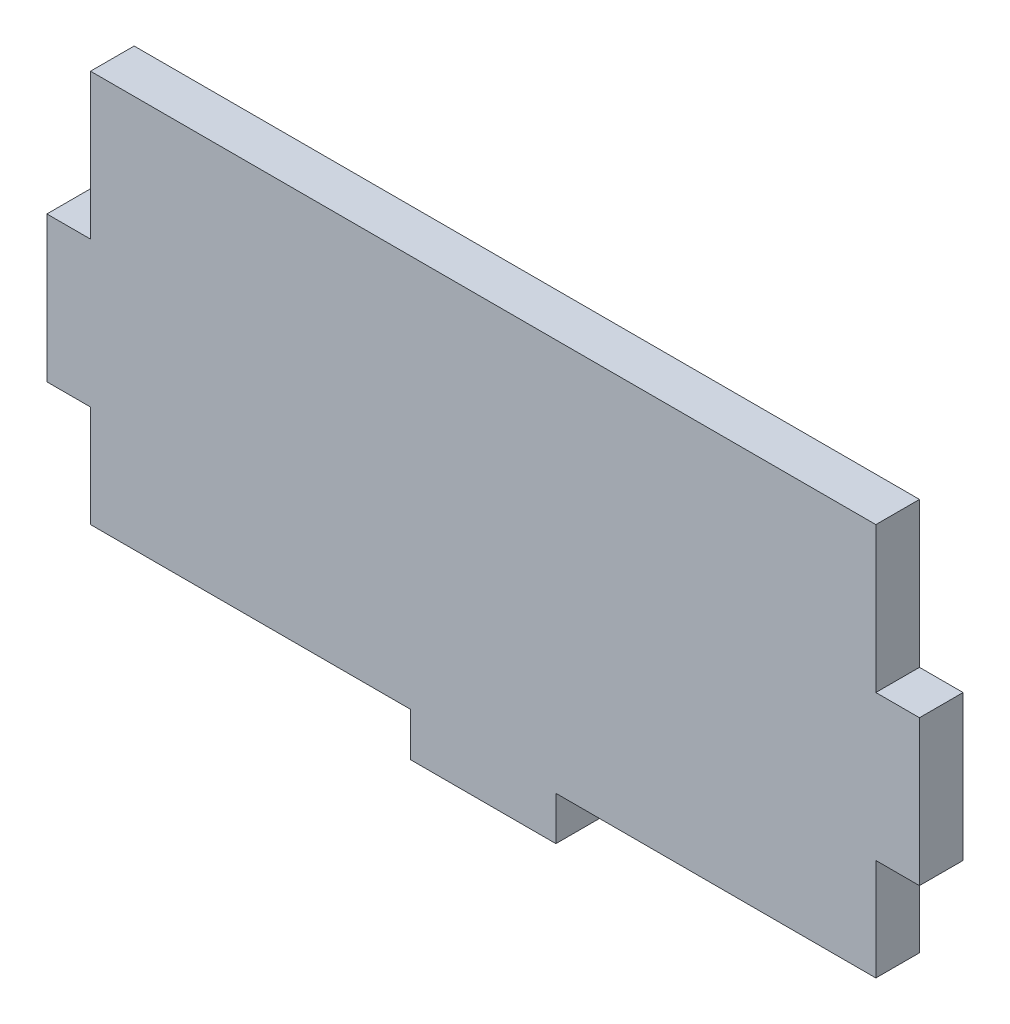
from build123d import *

# Parameters (mm, degrees)
BOSS_EXTRUDE1_DEPTH = 3


with BuildPart() as part:
    # Sketch1 → Boss-Extrude1 (new body)
    with BuildSketch(Plane.XY):
        Polygon((-89.357659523, -39.433680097), (-89.357659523, -46.433680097), (-67.357659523, -46.433680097), (-67.357659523, -49.433680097), (-57.357659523, -49.433680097), (-57.357659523, -46.433680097), (-35.357659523, -46.433680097), (-35.357659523, -39.433680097), (-32.357659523, -39.433680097), (-32.357659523, -29.433680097), (-35.357659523, -29.433680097), (-35.357659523, -19.433680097), (-89.357659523, -19.433680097), (-89.357659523, -29.433680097), (-92.357659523, -29.433680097), (-92.357659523, -39.433680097), align=None)
    extrude(amount=BOSS_EXTRUDE1_DEPTH)


solid = part.part
